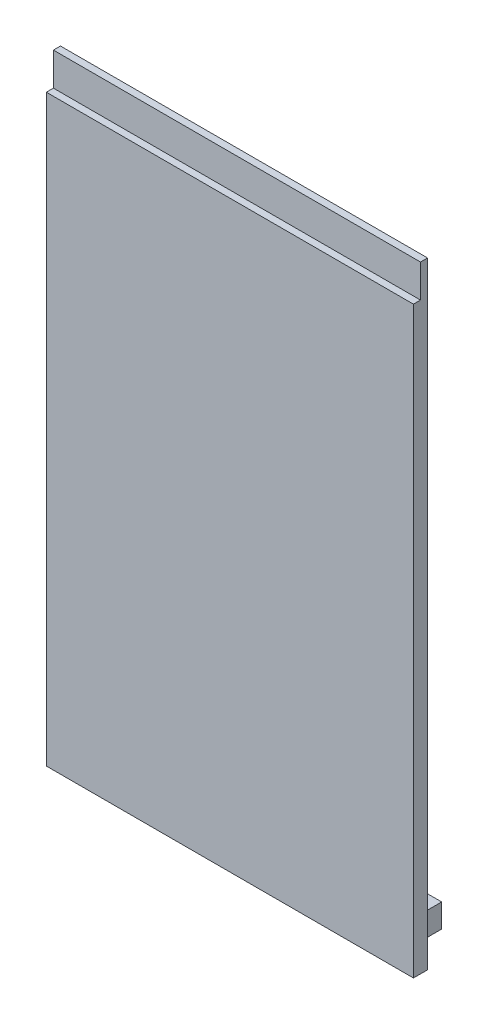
from build123d import *

# Parameters (mm, degrees)
SKETCH1_W           = 78
SKETCH1_H           = 249
BOSS_EXTRUDE1_DEPTH = 3
BOSS_EXTRUDE2_DEPTH = 78
SKETCH5_W           = 3
SKETCH5_H           = 6
CUT_EXTRUDE1_DEPTH  = 250.144536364
SKETCH6_R           = 1.5
CUT_EXTRUDE2_DEPTH  = 250.144536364
SKETCH7_R           = 5
CUT_EXTRUDE3_DEPTH  = 131.775571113
CUT_EXTRUDE4_DEPTH  = 148.038260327


with BuildPart() as part:
    # Sketch1 → Boss-Extrude1 (new body)
    with BuildSketch(Plane.XY):
        Rectangle(SKETCH1_W, SKETCH1_H)
    extrude(amount=BOSS_EXTRUDE1_DEPTH)

    # Sketch3 → Boss-Extrude2 (add, through all)
    with BuildSketch(Plane.ZY.offset(39)):
        Polygon((3, -124.5), (0, -124.5), (0, -121.5), (-6, -121.5), (-6, -116.5), (0, -116.5), (0, 116.5), (-6, 116.5), (-6, 121.5), (0, 121.5), (0, 124.5), (3, 124.5), align=None)
    extrude(amount=-BOSS_EXTRUDE2_DEPTH)

    # Sketch5 → Cut-Extrude1 (cut, through all)
    with BuildSketch(Plane(origin=(0, -121.5, 0), x_dir=(-1, 0, 0), z_dir=(0, -1, 0))):
        with Locations((37.5, 3)):
            Rectangle(SKETCH5_W, SKETCH5_H)
        with Locations((-37.5, 3)):
            Rectangle(SKETCH5_W, SKETCH5_H)
    extrude(amount=-CUT_EXTRUDE1_DEPTH, mode=Mode.SUBTRACT)

    # Sketch6 → Cut-Extrude2 (cut, through all)
    with BuildSketch(Plane.XZ.offset(121.5)):
        with Locations((-31, -3)):
            Circle(SKETCH6_R)
        with Locations((31, -3)):
            Circle(SKETCH6_R)
    extrude(amount=-CUT_EXTRUDE2_DEPTH, mode=Mode.SUBTRACT)

    # Sketch7 → Cut-Extrude3 (cut, through all)
    with BuildSketch(Plane.XY.offset(3)):
        with Locations((0, 99.5)):
            Circle(SKETCH7_R)
    extrude(amount=-CUT_EXTRUDE3_DEPTH, mode=Mode.SUBTRACT)

    # Sketch8 → Cut-Extrude4 (cut, through all)
    with BuildSketch(Plane.ZY.offset(39)):
        Polygon((0, 124.5), (3, 124.5), (3, -0.5), (1.5, -0.5), (1.5, 6.5), (0, 6.5), (0, 116.5), (-6, 116.5), (-6, 121.5), (0, 121.5), align=None)
    extrude(amount=-CUT_EXTRUDE4_DEPTH, mode=Mode.SUBTRACT)


solid = part.part
